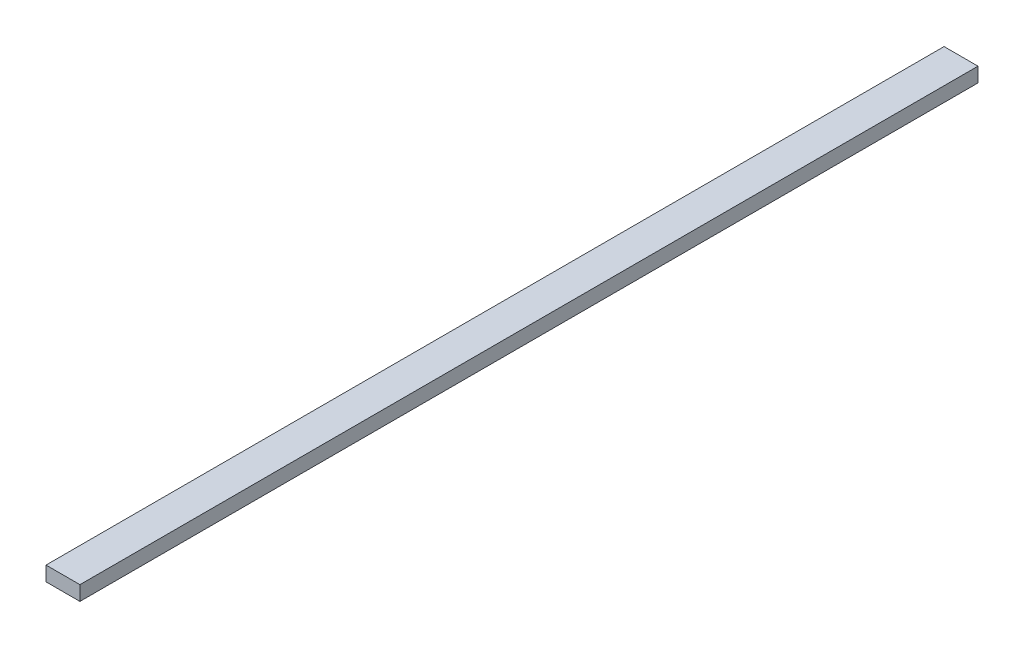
from build123d import *

# Parameters (mm, degrees)
SKETCH1_W           = 88.9
SKETCH1_H           = 2352.675
BOSS_EXTRUDE1_DEPTH = 38.1


with BuildPart() as part:
    # Sketch1 → Boss-Extrude1 (new body)
    with BuildSketch(Plane(origin=(0, 0, 0), x_dir=(1, 0, 0), z_dir=(0, 1, 0))):
        with Locations((-44.45, -1176.3375)):
            Rectangle(SKETCH1_W, SKETCH1_H)
    extrude(amount=BOSS_EXTRUDE1_DEPTH)


solid = part.part
